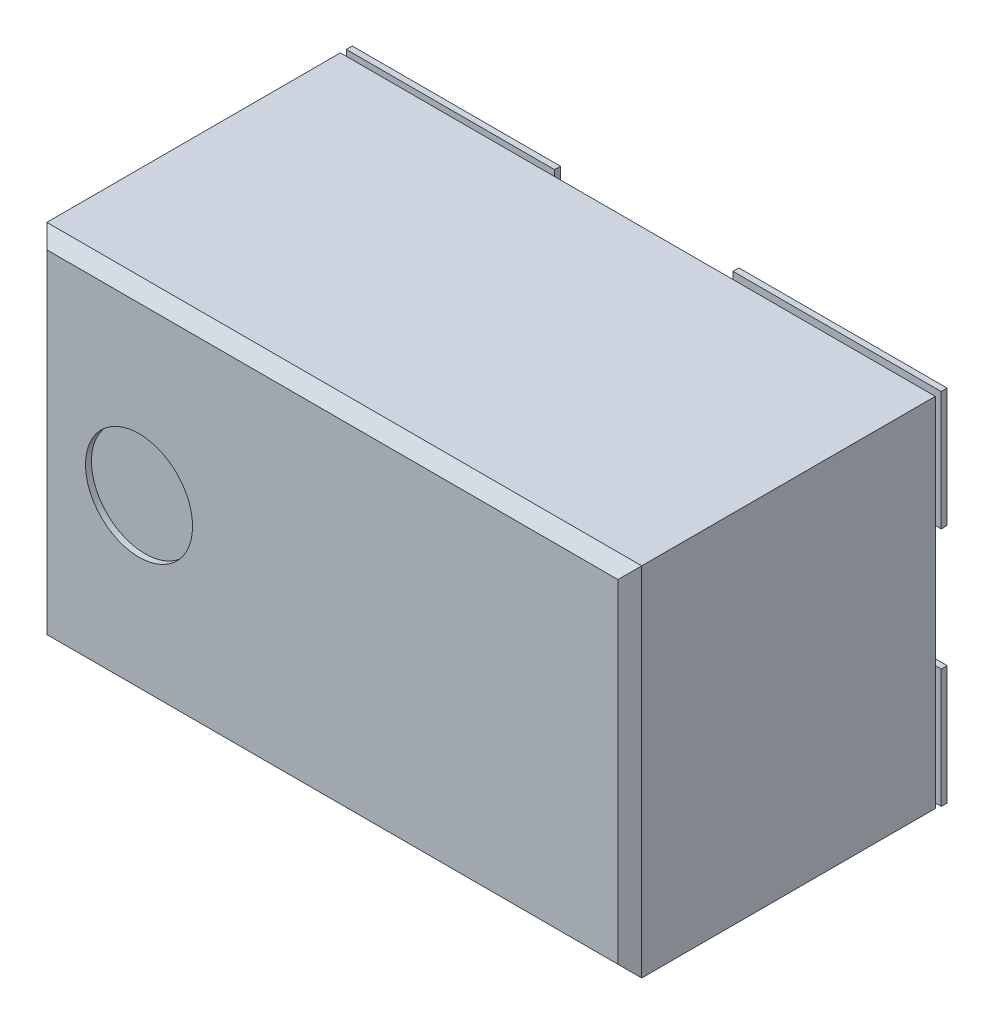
ISO-10303-21;
HEADER;
FILE_DESCRIPTION(('STEP AP214'),'2;1');
FILE_NAME('part.step','',(''),(''),'','','');
FILE_SCHEMA(('AUTOMOTIVE_DESIGN { 1 0 10303 214 1 1 1 1 }'));
ENDSEC;
DATA;
#1=APPLICATION_CONTEXT('core data for automotive mechanical design processes');
#2=APPLICATION_PROTOCOL_DEFINITION('international standard','automotive_design',2000,#1);
#3=PRODUCT_CONTEXT('',#1,'mechanical');
#4=PRODUCT('Part','Part','',(#3));
#5=PRODUCT_RELATED_PRODUCT_CATEGORY('part','',(#4));
#6=PRODUCT_DEFINITION_FORMATION('','',#4);
#7=PRODUCT_DEFINITION_CONTEXT('part definition',#1,'design');
#8=PRODUCT_DEFINITION('design','',#6,#7);
#9=PRODUCT_DEFINITION_SHAPE('','',#8);
#10=(LENGTH_UNIT() NAMED_UNIT(*) SI_UNIT(.MILLI.,.METRE.));
#11=(NAMED_UNIT(*) PLANE_ANGLE_UNIT() SI_UNIT($,.RADIAN.));
#12=(NAMED_UNIT(*) SI_UNIT($,.STERADIAN.) SOLID_ANGLE_UNIT());
#13=UNCERTAINTY_MEASURE_WITH_UNIT(LENGTH_MEASURE(1.E-05),#10,'distance_accuracy_value','');
#14=(GEOMETRIC_REPRESENTATION_CONTEXT(3) GLOBAL_UNCERTAINTY_ASSIGNED_CONTEXT((#13)) GLOBAL_UNIT_ASSIGNED_CONTEXT((#10,
#11,#12)) REPRESENTATION_CONTEXT('',''));
#15=CARTESIAN_POINT('',(0.,0.,0.));
#16=DIRECTION('',(0.,0.,1.));
#17=DIRECTION('',(1.,0.,0.));
#18=AXIS2_PLACEMENT_3D('',#15,#16,#17);
#19=CARTESIAN_POINT('',(0.,0.,0.0762));
#20=DIRECTION('',(0.,0.,1.));
#21=DIRECTION('',(1.,0.,0.));
#22=AXIS2_PLACEMENT_3D('',#19,#20,#21);
#23=PLANE('',#22);
#24=DIRECTION('',(1.,0.,0.));
#25=VECTOR('',#24,1.);
#26=CARTESIAN_POINT('',(-0.500000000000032,-0.30000000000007,0.0762));
#27=LINE('',#26,#25);
#28=CARTESIAN_POINT('',(-0.500000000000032,-0.30000000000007,0.0762));
#29=VERTEX_POINT('',#28);
#30=CARTESIAN_POINT('',(-0.15000000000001,-0.30000000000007,0.0762));
#31=VERTEX_POINT('',#30);
#32=EDGE_CURVE('E504',#29,#31,#27,.T.);
#33=ORIENTED_EDGE('',*,*,#32,.F.);
#34=DIRECTION('',(0.,1.,0.));
#35=VECTOR('',#34,1.);
#36=CARTESIAN_POINT('',(-0.500000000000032,0.30000000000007,0.0762));
#37=LINE('',#36,#35);
#38=CARTESIAN_POINT('',(-0.500000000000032,0.30000000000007,0.0762));
#39=VERTEX_POINT('',#38);
#40=EDGE_CURVE('E509',#39,#29,#37,.F.);
#41=ORIENTED_EDGE('',*,*,#40,.F.);
#42=DIRECTION('',(1.,0.,0.));
#43=VECTOR('',#42,1.);
#44=CARTESIAN_POINT('',(-0.15000000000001,0.30000000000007,0.0762));
#45=LINE('',#44,#43);
#46=CARTESIAN_POINT('',(-0.15000000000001,0.30000000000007,0.0762));
#47=VERTEX_POINT('',#46);
#48=EDGE_CURVE('E471',#47,#39,#45,.F.);
#49=ORIENTED_EDGE('',*,*,#48,.F.);
#50=DIRECTION('',(0.,1.,0.));
#51=VECTOR('',#50,1.);
#52=CARTESIAN_POINT('',(-0.15000000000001,-0.30000000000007,0.0762));
#53=LINE('',#52,#51);
#54=EDGE_CURVE('E499',#31,#47,#53,.T.);
#55=ORIENTED_EDGE('',*,*,#54,.F.);
#56=EDGE_LOOP('',(#33,#41,#49,#55));
#57=FACE_BOUND('',#56,.T.);
#58=ADVANCED_FACE('F16',(#57),#23,.F.);
#59=CARTESIAN_POINT('',(-0.500000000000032,0.30000000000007,0.0762));
#60=DIRECTION('',(-1.,0.,0.));
#61=DIRECTION('',(0.,0.,1.));
#62=AXIS2_PLACEMENT_3D('',#59,#60,#61);
#63=PLANE('',#62);
#64=DIRECTION('',(0.,0.,1.));
#65=VECTOR('',#64,1.);
#66=CARTESIAN_POINT('',(-0.500000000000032,0.30000000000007,0.0762));
#67=LINE('',#66,#65);
#68=CARTESIAN_POINT('',(-0.500000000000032,0.30000000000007,0.0862000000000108));
#69=VERTEX_POINT('',#68);
#70=EDGE_CURVE('E496',#39,#69,#67,.T.);
#71=ORIENTED_EDGE('',*,*,#70,.F.);
#72=ORIENTED_EDGE('',*,*,#40,.T.);
#73=DIRECTION('',(0.,0.,-1.));
#74=VECTOR('',#73,1.);
#75=CARTESIAN_POINT('',(-0.500000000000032,-0.30000000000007,0.0762));
#76=LINE('',#75,#74);
#77=CARTESIAN_POINT('',(-0.500000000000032,-0.30000000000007,0.0862000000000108));
#78=VERTEX_POINT('',#77);
#79=EDGE_CURVE('E506',#78,#29,#76,.T.);
#80=ORIENTED_EDGE('',*,*,#79,.F.);
#81=DIRECTION('',(0.,1.,0.));
#82=VECTOR('',#81,1.);
#83=CARTESIAN_POINT('',(-0.500000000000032,0.,0.0862000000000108));
#84=LINE('',#83,#82);
#85=EDGE_CURVE('E406',#69,#78,#84,.F.);
#86=ORIENTED_EDGE('',*,*,#85,.F.);
#87=EDGE_LOOP('',(#71,#72,#80,#86));
#88=FACE_BOUND('',#87,.T.);
#89=ADVANCED_FACE('F809',(#88),#63,.T.);
#90=CARTESIAN_POINT('',(-0.500000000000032,-0.30000000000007,0.0762));
#91=DIRECTION('',(0.,-1.,0.));
#92=DIRECTION('',(0.,0.,-1.));
#93=AXIS2_PLACEMENT_3D('',#90,#91,#92);
#94=PLANE('',#93);
#95=ORIENTED_EDGE('',*,*,#79,.T.);
#96=ORIENTED_EDGE('',*,*,#32,.T.);
#97=DIRECTION('',(0.,0.,-1.));
#98=VECTOR('',#97,1.);
#99=CARTESIAN_POINT('',(-0.15000000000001,-0.30000000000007,0.0762));
#100=LINE('',#99,#98);
#101=CARTESIAN_POINT('',(-0.15000000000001,-0.30000000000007,0.0862000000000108));
#102=VERTEX_POINT('',#101);
#103=EDGE_CURVE('E501',#102,#31,#100,.T.);
#104=ORIENTED_EDGE('',*,*,#103,.F.);
#105=DIRECTION('',(1.,0.,0.));
#106=VECTOR('',#105,1.);
#107=CARTESIAN_POINT('',(0.,-0.30000000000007,0.0862000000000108));
#108=LINE('',#107,#106);
#109=EDGE_CURVE('E403',#78,#102,#108,.T.);
#110=ORIENTED_EDGE('',*,*,#109,.F.);
#111=EDGE_LOOP('',(#95,#96,#104,#110));
#112=FACE_BOUND('',#111,.T.);
#113=ADVANCED_FACE('F806',(#112),#94,.T.);
#114=CARTESIAN_POINT('',(-0.15000000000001,-0.30000000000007,0.0762));
#115=DIRECTION('',(1.,0.,0.));
#116=DIRECTION('',(0.,0.,-1.));
#117=AXIS2_PLACEMENT_3D('',#114,#115,#116);
#118=PLANE('',#117);
#119=ORIENTED_EDGE('',*,*,#103,.T.);
#120=ORIENTED_EDGE('',*,*,#54,.T.);
#121=DIRECTION('',(0.,0.,1.));
#122=VECTOR('',#121,1.);
#123=CARTESIAN_POINT('',(-0.15000000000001,0.30000000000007,0.0762));
#124=LINE('',#123,#122);
#125=CARTESIAN_POINT('',(-0.15000000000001,0.30000000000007,0.0862000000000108));
#126=VERTEX_POINT('',#125);
#127=EDGE_CURVE('E493',#126,#47,#124,.F.);
#128=ORIENTED_EDGE('',*,*,#127,.F.);
#129=DIRECTION('',(0.,1.,0.));
#130=VECTOR('',#129,1.);
#131=CARTESIAN_POINT('',(-0.15000000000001,0.,0.0862000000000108));
#132=LINE('',#131,#130);
#133=EDGE_CURVE('E400',#102,#126,#132,.T.);
#134=ORIENTED_EDGE('',*,*,#133,.F.);
#135=EDGE_LOOP('',(#119,#120,#128,#134));
#136=FACE_BOUND('',#135,.T.);
#137=ADVANCED_FACE('F802',(#136),#118,.T.);
#138=CARTESIAN_POINT('',(-0.15000000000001,0.30000000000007,0.0762));
#139=DIRECTION('',(0.,1.,0.));
#140=DIRECTION('',(0.,0.,1.));
#141=AXIS2_PLACEMENT_3D('',#138,#139,#140);
#142=PLANE('',#141);
#143=ORIENTED_EDGE('',*,*,#127,.T.);
#144=ORIENTED_EDGE('',*,*,#48,.T.);
#145=ORIENTED_EDGE('',*,*,#70,.T.);
#146=DIRECTION('',(1.,0.,0.));
#147=VECTOR('',#146,1.);
#148=CARTESIAN_POINT('',(0.,0.30000000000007,0.0862000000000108));
#149=LINE('',#148,#147);
#150=EDGE_CURVE('E396',#126,#69,#149,.F.);
#151=ORIENTED_EDGE('',*,*,#150,.F.);
#152=EDGE_LOOP('',(#143,#144,#145,#151));
#153=FACE_BOUND('',#152,.T.);
#154=ADVANCED_FACE('F798',(#153),#142,.T.);
#155=CARTESIAN_POINT('',(0.500000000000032,0.101999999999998,0.0762));
#156=DIRECTION('',(1.,0.,0.));
#157=DIRECTION('',(0.,0.,-1.));
#158=AXIS2_PLACEMENT_3D('',#155,#156,#157);
#159=PLANE('',#158);
#160=DIRECTION('',(0.,0.,-1.));
#161=VECTOR('',#160,1.);
#162=CARTESIAN_POINT('',(0.500000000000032,0.101999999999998,0.0762));
#163=LINE('',#162,#161);
#164=CARTESIAN_POINT('',(0.500000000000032,0.101999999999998,0.0762));
#165=VERTEX_POINT('',#164);
#166=CARTESIAN_POINT('',(0.500000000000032,0.101999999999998,0.0862000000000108));
#167=VERTEX_POINT('',#166);
#168=EDGE_CURVE('E399',#165,#167,#163,.F.);
#169=ORIENTED_EDGE('',*,*,#168,.F.);
#170=DIRECTION('',(0.,1.,0.));
#171=VECTOR('',#170,1.);
#172=CARTESIAN_POINT('',(0.500000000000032,0.,0.0762));
#173=LINE('',#172,#171);
#174=CARTESIAN_POINT('',(0.500000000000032,0.302000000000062,0.0762));
#175=VERTEX_POINT('',#174);
#176=EDGE_CURVE('E247',#165,#175,#173,.T.);
#177=ORIENTED_EDGE('',*,*,#176,.T.);
#178=DIRECTION('',(0.,0.,1.));
#179=VECTOR('',#178,1.);
#180=CARTESIAN_POINT('',(0.500000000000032,0.302000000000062,0.0762));
#181=LINE('',#180,#179);
#182=CARTESIAN_POINT('',(0.500000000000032,0.302000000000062,0.0862000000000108));
#183=VERTEX_POINT('',#182);
#184=EDGE_CURVE('E462',#183,#175,#181,.F.);
#185=ORIENTED_EDGE('',*,*,#184,.F.);
#186=DIRECTION('',(0.,1.,0.));
#187=VECTOR('',#186,1.);
#188=CARTESIAN_POINT('',(0.500000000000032,0.,0.0862000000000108));
#189=LINE('',#188,#187);
#190=EDGE_CURVE('E389',#167,#183,#189,.T.);
#191=ORIENTED_EDGE('',*,*,#190,.F.);
#192=EDGE_LOOP('',(#169,#177,#185,#191));
#193=FACE_BOUND('',#192,.T.);
#194=ADVANCED_FACE('F794',(#193),#159,.T.);
#195=CARTESIAN_POINT('',(0.500000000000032,0.302000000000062,0.0762));
#196=DIRECTION('',(0.,1.,0.));
#197=DIRECTION('',(0.,0.,1.));
#198=AXIS2_PLACEMENT_3D('',#195,#196,#197);
#199=PLANE('',#198);
#200=ORIENTED_EDGE('',*,*,#184,.T.);
#201=DIRECTION('',(1.,0.,0.));
#202=VECTOR('',#201,1.);
#203=CARTESIAN_POINT('',(0.,0.302000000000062,0.0762));
#204=LINE('',#203,#202);
#205=CARTESIAN_POINT('',(0.15000000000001,0.302000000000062,0.0762));
#206=VERTEX_POINT('',#205);
#207=EDGE_CURVE('E482',#175,#206,#204,.F.);
#208=ORIENTED_EDGE('',*,*,#207,.T.);
#209=DIRECTION('',(0.,0.,1.));
#210=VECTOR('',#209,1.);
#211=CARTESIAN_POINT('',(0.15000000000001,0.302000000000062,0.0762));
#212=LINE('',#211,#210);
#213=CARTESIAN_POINT('',(0.15000000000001,0.302000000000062,0.0862000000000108));
#214=VERTEX_POINT('',#213);
#215=EDGE_CURVE('E431',#214,#206,#212,.F.);
#216=ORIENTED_EDGE('',*,*,#215,.F.);
#217=DIRECTION('',(1.,0.,0.));
#218=VECTOR('',#217,1.);
#219=CARTESIAN_POINT('',(0.,0.302000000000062,0.0862000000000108));
#220=LINE('',#219,#218);
#221=EDGE_CURVE('E457',#183,#214,#220,.F.);
#222=ORIENTED_EDGE('',*,*,#221,.F.);
#223=EDGE_LOOP('',(#200,#208,#216,#222));
#224=FACE_BOUND('',#223,.T.);
#225=ADVANCED_FACE('F790',(#224),#199,.T.);
#226=CARTESIAN_POINT('',(0.15000000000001,0.302000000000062,0.0762));
#227=DIRECTION('',(-1.,0.,0.));
#228=DIRECTION('',(0.,0.,1.));
#229=AXIS2_PLACEMENT_3D('',#226,#227,#228);
#230=PLANE('',#229);
#231=ORIENTED_EDGE('',*,*,#215,.T.);
#232=DIRECTION('',(0.,1.,0.));
#233=VECTOR('',#232,1.);
#234=CARTESIAN_POINT('',(0.15000000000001,0.,0.0762));
#235=LINE('',#234,#233);
#236=CARTESIAN_POINT('',(0.15000000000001,0.101999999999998,0.0762));
#237=VERTEX_POINT('',#236);
#238=EDGE_CURVE('E365',#206,#237,#235,.F.);
#239=ORIENTED_EDGE('',*,*,#238,.T.);
#240=DIRECTION('',(0.,0.,-1.));
#241=VECTOR('',#240,1.);
#242=CARTESIAN_POINT('',(0.15000000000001,0.101999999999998,0.0762));
#243=LINE('',#242,#241);
#244=CARTESIAN_POINT('',(0.15000000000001,0.101999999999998,0.0862000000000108));
#245=VERTEX_POINT('',#244);
#246=EDGE_CURVE('E249',#245,#237,#243,.T.);
#247=ORIENTED_EDGE('',*,*,#246,.F.);
#248=DIRECTION('',(0.,1.,0.));
#249=VECTOR('',#248,1.);
#250=CARTESIAN_POINT('',(0.15000000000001,0.,0.0862000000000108));
#251=LINE('',#250,#249);
#252=EDGE_CURVE('E374',#214,#245,#251,.F.);
#253=ORIENTED_EDGE('',*,*,#252,.F.);
#254=EDGE_LOOP('',(#231,#239,#247,#253));
#255=FACE_BOUND('',#254,.T.);
#256=ADVANCED_FACE('F786',(#255),#230,.T.);
#257=CARTESIAN_POINT('',(0.15000000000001,-0.101999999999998,0.0762));
#258=DIRECTION('',(-1.,0.,0.));
#259=DIRECTION('',(0.,0.,1.));
#260=AXIS2_PLACEMENT_3D('',#257,#258,#259);
#261=PLANE('',#260);
#262=DIRECTION('',(0.,0.,1.));
#263=VECTOR('',#262,1.);
#264=CARTESIAN_POINT('',(0.15000000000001,-0.101999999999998,0.0762));
#265=LINE('',#264,#263);
#266=CARTESIAN_POINT('',(0.15000000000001,-0.101999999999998,0.0762));
#267=VERTEX_POINT('',#266);
#268=CARTESIAN_POINT('',(0.15000000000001,-0.101999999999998,0.0862000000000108));
#269=VERTEX_POINT('',#268);
#270=EDGE_CURVE('E295',#267,#269,#265,.T.);
#271=ORIENTED_EDGE('',*,*,#270,.F.);
#272=DIRECTION('',(0.,1.,0.));
#273=VECTOR('',#272,1.);
#274=CARTESIAN_POINT('',(0.15000000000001,0.,0.0762));
#275=LINE('',#274,#273);
#276=CARTESIAN_POINT('',(0.15000000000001,-0.302000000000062,0.0762));
#277=VERTEX_POINT('',#276);
#278=EDGE_CURVE('E412',#267,#277,#275,.F.);
#279=ORIENTED_EDGE('',*,*,#278,.T.);
#280=DIRECTION('',(0.,0.,-1.));
#281=VECTOR('',#280,1.);
#282=CARTESIAN_POINT('',(0.15000000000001,-0.302000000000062,0.0762));
#283=LINE('',#282,#281);
#284=CARTESIAN_POINT('',(0.15000000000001,-0.302000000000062,0.0862000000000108));
#285=VERTEX_POINT('',#284);
#286=EDGE_CURVE('E422',#285,#277,#283,.T.);
#287=ORIENTED_EDGE('',*,*,#286,.F.);
#288=DIRECTION('',(0.,1.,0.));
#289=VECTOR('',#288,1.);
#290=CARTESIAN_POINT('',(0.15000000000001,0.,0.0862000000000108));
#291=LINE('',#290,#289);
#292=EDGE_CURVE('E308',#269,#285,#291,.F.);
#293=ORIENTED_EDGE('',*,*,#292,.F.);
#294=EDGE_LOOP('',(#271,#279,#287,#293));
#295=FACE_BOUND('',#294,.T.);
#296=ADVANCED_FACE('F782',(#295),#261,.T.);
#297=CARTESIAN_POINT('',(0.15000000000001,-0.302000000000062,0.0762));
#298=DIRECTION('',(0.,-1.,0.));
#299=DIRECTION('',(0.,0.,-1.));
#300=AXIS2_PLACEMENT_3D('',#297,#298,#299);
#301=PLANE('',#300);
#302=ORIENTED_EDGE('',*,*,#286,.T.);
#303=DIRECTION('',(1.,0.,0.));
#304=VECTOR('',#303,1.);
#305=CARTESIAN_POINT('',(0.,-0.302000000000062,0.0762));
#306=LINE('',#305,#304);
#307=CARTESIAN_POINT('',(0.500000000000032,-0.302000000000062,0.0762));
#308=VERTEX_POINT('',#307);
#309=EDGE_CURVE('E442',#277,#308,#306,.T.);
#310=ORIENTED_EDGE('',*,*,#309,.T.);
#311=DIRECTION('',(0.,0.,-1.));
#312=VECTOR('',#311,1.);
#313=CARTESIAN_POINT('',(0.500000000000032,-0.302000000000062,0.0762));
#314=LINE('',#313,#312);
#315=CARTESIAN_POINT('',(0.500000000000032,-0.302000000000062,0.0862000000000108));
#316=VERTEX_POINT('',#315);
#317=EDGE_CURVE('E409',#316,#308,#314,.T.);
#318=ORIENTED_EDGE('',*,*,#317,.F.);
#319=DIRECTION('',(1.,0.,0.));
#320=VECTOR('',#319,1.);
#321=CARTESIAN_POINT('',(0.,-0.302000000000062,0.0862000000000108));
#322=LINE('',#321,#320);
#323=EDGE_CURVE('E417',#285,#316,#322,.T.);
#324=ORIENTED_EDGE('',*,*,#323,.F.);
#325=EDGE_LOOP('',(#302,#310,#318,#324));
#326=FACE_BOUND('',#325,.T.);
#327=ADVANCED_FACE('F778',(#326),#301,.T.);
#328=CARTESIAN_POINT('',(0.500000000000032,-0.302000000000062,0.0762));
#329=DIRECTION('',(1.,0.,0.));
#330=DIRECTION('',(0.,0.,-1.));
#331=AXIS2_PLACEMENT_3D('',#328,#329,#330);
#332=PLANE('',#331);
#333=ORIENTED_EDGE('',*,*,#317,.T.);
#334=DIRECTION('',(0.,1.,0.));
#335=VECTOR('',#334,1.);
#336=CARTESIAN_POINT('',(0.500000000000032,0.,0.0762));
#337=LINE('',#336,#335);
#338=CARTESIAN_POINT('',(0.500000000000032,-0.101999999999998,0.0762));
#339=VERTEX_POINT('',#338);
#340=EDGE_CURVE('E312',#308,#339,#337,.T.);
#341=ORIENTED_EDGE('',*,*,#340,.T.);
#342=DIRECTION('',(0.,0.,1.));
#343=VECTOR('',#342,1.);
#344=CARTESIAN_POINT('',(0.500000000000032,-0.101999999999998,0.0762));
#345=LINE('',#344,#343);
#346=CARTESIAN_POINT('',(0.500000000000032,-0.101999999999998,0.0862000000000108));
#347=VERTEX_POINT('',#346);
#348=EDGE_CURVE('E373',#347,#339,#345,.F.);
#349=ORIENTED_EDGE('',*,*,#348,.F.);
#350=DIRECTION('',(0.,1.,0.));
#351=VECTOR('',#350,1.);
#352=CARTESIAN_POINT('',(0.500000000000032,0.,0.0862000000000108));
#353=LINE('',#352,#351);
#354=EDGE_CURVE('E343',#316,#347,#353,.T.);
#355=ORIENTED_EDGE('',*,*,#354,.F.);
#356=EDGE_LOOP('',(#333,#341,#349,#355));
#357=FACE_BOUND('',#356,.T.);
#358=ADVANCED_FACE('F774',(#357),#332,.T.);
#359=CARTESIAN_POINT('',(0.,0.,0.0862000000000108));
#360=DIRECTION('',(0.,0.,1.));
#361=DIRECTION('',(1.,0.,0.));
#362=AXIS2_PLACEMENT_3D('',#359,#360,#361);
#363=PLANE('',#362);
#364=DIRECTION('',(1.,0.,0.));
#365=VECTOR('',#364,1.);
#366=CARTESIAN_POINT('',(-0.449999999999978,-0.249999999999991,0.0862000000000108));
#367=LINE('',#366,#365);
#368=CARTESIAN_POINT('',(-0.449999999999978,-0.249999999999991,0.0862000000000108));
#369=VERTEX_POINT('',#368);
#370=CARTESIAN_POINT('',(-0.199999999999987,-0.249999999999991,0.0862000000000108));
#371=VERTEX_POINT('',#370);
#372=EDGE_CURVE('E289',#369,#371,#367,.T.);
#373=ORIENTED_EDGE('',*,*,#372,.F.);
#374=DIRECTION('',(0.,1.,0.));
#375=VECTOR('',#374,1.);
#376=CARTESIAN_POINT('',(-0.449999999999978,0.249999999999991,0.0862000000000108));
#377=LINE('',#376,#375);
#378=CARTESIAN_POINT('',(-0.449999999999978,0.249999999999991,0.0862000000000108));
#379=VERTEX_POINT('',#378);
#380=EDGE_CURVE('E264',#379,#369,#377,.F.);
#381=ORIENTED_EDGE('',*,*,#380,.F.);
#382=DIRECTION('',(1.,0.,0.));
#383=VECTOR('',#382,1.);
#384=CARTESIAN_POINT('',(-0.199999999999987,0.249999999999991,0.0862000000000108));
#385=LINE('',#384,#383);
#386=CARTESIAN_POINT('',(-0.199999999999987,0.249999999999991,0.0862000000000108));
#387=VERTEX_POINT('',#386);
#388=EDGE_CURVE('E279',#387,#379,#385,.F.);
#389=ORIENTED_EDGE('',*,*,#388,.F.);
#390=DIRECTION('',(0.,1.,0.));
#391=VECTOR('',#390,1.);
#392=CARTESIAN_POINT('',(-0.199999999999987,-0.249999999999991,0.0862000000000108));
#393=LINE('',#392,#391);
#394=EDGE_CURVE('E284',#371,#387,#393,.T.);
#395=ORIENTED_EDGE('',*,*,#394,.F.);
#396=EDGE_LOOP('',(#373,#381,#389,#395));
#397=FACE_BOUND('',#396,.T.);
#398=ORIENTED_EDGE('',*,*,#133,.T.);
#399=ORIENTED_EDGE('',*,*,#150,.T.);
#400=ORIENTED_EDGE('',*,*,#85,.T.);
#401=ORIENTED_EDGE('',*,*,#109,.T.);
#402=EDGE_LOOP('',(#398,#399,#400,#401));
#403=FACE_BOUND('',#402,.T.);
#404=ADVANCED_FACE('F771',(#397,#403),#363,.T.);
#405=CARTESIAN_POINT('',(0.15000000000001,0.101999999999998,0.0762));
#406=DIRECTION('',(0.,-1.,0.));
#407=DIRECTION('',(0.,0.,-1.));
#408=AXIS2_PLACEMENT_3D('',#405,#406,#407);
#409=PLANE('',#408);
#410=DIRECTION('',(1.,0.,0.));
#411=VECTOR('',#410,1.);
#412=CARTESIAN_POINT('',(0.,0.101999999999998,0.0862000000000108));
#413=LINE('',#412,#411);
#414=CARTESIAN_POINT('',(0.449999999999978,0.101999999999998,0.0862000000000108));
#415=VERTEX_POINT('',#414);
#416=EDGE_CURVE('E255',#415,#167,#413,.T.);
#417=ORIENTED_EDGE('',*,*,#416,.F.);
#418=DIRECTION('',(0.,0.,-1.));
#419=VECTOR('',#418,1.);
#420=CARTESIAN_POINT('',(0.449999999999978,0.101999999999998,0.0762));
#421=LINE('',#420,#419);
#422=CARTESIAN_POINT('',(0.449999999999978,0.101999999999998,0.0762));
#423=VERTEX_POINT('',#422);
#424=EDGE_CURVE('E252',#423,#415,#421,.F.);
#425=ORIENTED_EDGE('',*,*,#424,.F.);
#426=DIRECTION('',(1.,0.,0.));
#427=VECTOR('',#426,1.);
#428=CARTESIAN_POINT('',(0.,0.101999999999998,0.0762));
#429=LINE('',#428,#427);
#430=EDGE_CURVE('E240',#423,#165,#429,.T.);
#431=ORIENTED_EDGE('',*,*,#430,.T.);
#432=ORIENTED_EDGE('',*,*,#168,.T.);
#433=EDGE_LOOP('',(#417,#425,#431,#432));
#434=FACE_BOUND('',#433,.T.);
#435=ADVANCED_FACE('F253',(#434),#409,.T.);
#436=CARTESIAN_POINT('',(0.15000000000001,0.101999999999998,0.0762));
#437=DIRECTION('',(0.,-1.,0.));
#438=DIRECTION('',(0.,0.,-1.));
#439=AXIS2_PLACEMENT_3D('',#436,#437,#438);
#440=PLANE('',#439);
#441=DIRECTION('',(1.,0.,0.));
#442=VECTOR('',#441,1.);
#443=CARTESIAN_POINT('',(0.,0.101999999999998,0.0762));
#444=LINE('',#443,#442);
#445=CARTESIAN_POINT('',(0.199999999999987,0.101999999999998,0.0762));
#446=VERTEX_POINT('',#445);
#447=EDGE_CURVE('E363',#237,#446,#444,.T.);
#448=ORIENTED_EDGE('',*,*,#447,.T.);
#449=DIRECTION('',(0.,0.,1.));
#450=VECTOR('',#449,1.);
#451=CARTESIAN_POINT('',(0.199999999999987,0.101999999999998,0.0762));
#452=LINE('',#451,#450);
#453=CARTESIAN_POINT('',(0.199999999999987,0.101999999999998,0.0862000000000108));
#454=VERTEX_POINT('',#453);
#455=EDGE_CURVE('E522',#454,#446,#452,.F.);
#456=ORIENTED_EDGE('',*,*,#455,.F.);
#457=DIRECTION('',(1.,0.,0.));
#458=VECTOR('',#457,1.);
#459=CARTESIAN_POINT('',(0.,0.101999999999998,0.0862000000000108));
#460=LINE('',#459,#458);
#461=EDGE_CURVE('E370',#245,#454,#460,.T.);
#462=ORIENTED_EDGE('',*,*,#461,.F.);
#463=ORIENTED_EDGE('',*,*,#246,.T.);
#464=EDGE_LOOP('',(#448,#456,#462,#463));
#465=FACE_BOUND('',#464,.T.);
#466=ADVANCED_FACE('F765',(#465),#440,.T.);
#467=CARTESIAN_POINT('',(0.,0.,0.0762));
#468=DIRECTION('',(0.,0.,1.));
#469=DIRECTION('',(1.,0.,0.));
#470=AXIS2_PLACEMENT_3D('',#467,#468,#469);
#471=PLANE('',#470);
#472=DIRECTION('',(0.,1.,0.));
#473=VECTOR('',#472,1.);
#474=CARTESIAN_POINT('',(0.199999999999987,0.249999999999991,0.0762));
#475=LINE('',#474,#473);
#476=CARTESIAN_POINT('',(0.199999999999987,0.100000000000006,0.0762));
#477=VERTEX_POINT('',#476);
#478=EDGE_CURVE('E519',#446,#477,#475,.F.);
#479=ORIENTED_EDGE('',*,*,#478,.F.);
#480=ORIENTED_EDGE('',*,*,#447,.F.);
#481=ORIENTED_EDGE('',*,*,#238,.F.);
#482=ORIENTED_EDGE('',*,*,#207,.F.);
#483=ORIENTED_EDGE('',*,*,#176,.F.);
#484=ORIENTED_EDGE('',*,*,#430,.F.);
#485=DIRECTION('',(0.,1.,0.));
#486=VECTOR('',#485,1.);
#487=CARTESIAN_POINT('',(0.449999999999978,0.100000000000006,0.0762));
#488=LINE('',#487,#486);
#489=CARTESIAN_POINT('',(0.449999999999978,0.100000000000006,0.0762));
#490=VERTEX_POINT('',#489);
#491=EDGE_CURVE('E19',#490,#423,#488,.T.);
#492=ORIENTED_EDGE('',*,*,#491,.F.);
#493=DIRECTION('',(1.,0.,0.));
#494=VECTOR('',#493,1.);
#495=CARTESIAN_POINT('',(0.199999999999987,0.100000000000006,0.0762));
#496=LINE('',#495,#494);
#497=EDGE_CURVE('E234',#477,#490,#496,.T.);
#498=ORIENTED_EDGE('',*,*,#497,.F.);
#499=EDGE_LOOP('',(#479,#480,#481,#482,#483,#484,#492,#498));
#500=FACE_BOUND('',#499,.T.);
#501=ADVANCED_FACE('F243',(#500),#471,.F.);
#502=CARTESIAN_POINT('',(0.,0.,0.0862000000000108));
#503=DIRECTION('',(0.,0.,1.));
#504=DIRECTION('',(1.,0.,0.));
#505=AXIS2_PLACEMENT_3D('',#502,#503,#504);
#506=PLANE('',#505);
#507=ORIENTED_EDGE('',*,*,#461,.T.);
#508=DIRECTION('',(0.,1.,0.));
#509=VECTOR('',#508,1.);
#510=CARTESIAN_POINT('',(0.199999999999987,0.249999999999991,0.0862000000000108));
#511=LINE('',#510,#509);
#512=CARTESIAN_POINT('',(0.199999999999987,0.249999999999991,0.0862000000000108));
#513=VERTEX_POINT('',#512);
#514=EDGE_CURVE('E377',#513,#454,#511,.F.);
#515=ORIENTED_EDGE('',*,*,#514,.F.);
#516=DIRECTION('',(1.,0.,0.));
#517=VECTOR('',#516,1.);
#518=CARTESIAN_POINT('',(0.449999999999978,0.249999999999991,0.0862000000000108));
#519=LINE('',#518,#517);
#520=CARTESIAN_POINT('',(0.449999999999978,0.249999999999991,0.0862000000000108));
#521=VERTEX_POINT('',#520);
#522=EDGE_CURVE('E527',#521,#513,#519,.F.);
#523=ORIENTED_EDGE('',*,*,#522,.F.);
#524=DIRECTION('',(0.,1.,0.));
#525=VECTOR('',#524,1.);
#526=CARTESIAN_POINT('',(0.449999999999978,0.100000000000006,0.0862000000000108));
#527=LINE('',#526,#525);
#528=EDGE_CURVE('E258',#415,#521,#527,.T.);
#529=ORIENTED_EDGE('',*,*,#528,.F.);
#530=ORIENTED_EDGE('',*,*,#416,.T.);
#531=ORIENTED_EDGE('',*,*,#190,.T.);
#532=ORIENTED_EDGE('',*,*,#221,.T.);
#533=ORIENTED_EDGE('',*,*,#252,.T.);
#534=EDGE_LOOP('',(#507,#515,#523,#529,#530,#531,#532,#533));
#535=FACE_BOUND('',#534,.T.);
#536=ADVANCED_FACE('F543',(#535),#506,.T.);
#537=CARTESIAN_POINT('',(0.500000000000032,-0.101999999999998,0.0762));
#538=DIRECTION('',(0.,1.,0.));
#539=DIRECTION('',(0.,0.,1.));
#540=AXIS2_PLACEMENT_3D('',#537,#538,#539);
#541=PLANE('',#540);
#542=DIRECTION('',(1.,0.,0.));
#543=VECTOR('',#542,1.);
#544=CARTESIAN_POINT('',(0.,-0.101999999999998,0.0762));
#545=LINE('',#544,#543);
#546=CARTESIAN_POINT('',(0.449999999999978,-0.101999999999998,0.0762));
#547=VERTEX_POINT('',#546);
#548=EDGE_CURVE('E296',#339,#547,#545,.F.);
#549=ORIENTED_EDGE('',*,*,#548,.T.);
#550=DIRECTION('',(0.,0.,-1.));
#551=VECTOR('',#550,1.);
#552=CARTESIAN_POINT('',(0.449999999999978,-0.101999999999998,0.0762));
#553=LINE('',#552,#551);
#554=CARTESIAN_POINT('',(0.449999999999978,-0.101999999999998,0.0862000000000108));
#555=VERTEX_POINT('',#554);
#556=EDGE_CURVE('E380',#555,#547,#553,.T.);
#557=ORIENTED_EDGE('',*,*,#556,.F.);
#558=DIRECTION('',(1.,0.,0.));
#559=VECTOR('',#558,1.);
#560=CARTESIAN_POINT('',(0.,-0.101999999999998,0.0862000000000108));
#561=LINE('',#560,#559);
#562=EDGE_CURVE('E291',#347,#555,#561,.F.);
#563=ORIENTED_EDGE('',*,*,#562,.F.);
#564=ORIENTED_EDGE('',*,*,#348,.T.);
#565=EDGE_LOOP('',(#549,#557,#563,#564));
#566=FACE_BOUND('',#565,.T.);
#567=ADVANCED_FACE('F756',(#566),#541,.T.);
#568=CARTESIAN_POINT('',(0.,0.,0.0762));
#569=DIRECTION('',(0.,0.,1.));
#570=DIRECTION('',(1.,0.,0.));
#571=AXIS2_PLACEMENT_3D('',#568,#569,#570);
#572=PLANE('',#571);
#573=DIRECTION('',(0.,1.,0.));
#574=VECTOR('',#573,1.);
#575=CARTESIAN_POINT('',(0.449999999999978,-0.249999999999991,0.0762));
#576=LINE('',#575,#574);
#577=CARTESIAN_POINT('',(0.449999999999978,-0.100000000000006,0.0762));
#578=VERTEX_POINT('',#577);
#579=EDGE_CURVE('E348',#547,#578,#576,.T.);
#580=ORIENTED_EDGE('',*,*,#579,.F.);
#581=ORIENTED_EDGE('',*,*,#548,.F.);
#582=ORIENTED_EDGE('',*,*,#340,.F.);
#583=ORIENTED_EDGE('',*,*,#309,.F.);
#584=ORIENTED_EDGE('',*,*,#278,.F.);
#585=DIRECTION('',(1.,0.,0.));
#586=VECTOR('',#585,1.);
#587=CARTESIAN_POINT('',(0.500000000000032,-0.101999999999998,0.0762));
#588=LINE('',#587,#586);
#589=CARTESIAN_POINT('',(0.199999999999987,-0.101999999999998,0.0762));
#590=VERTEX_POINT('',#589);
#591=EDGE_CURVE('E292',#590,#267,#588,.F.);
#592=ORIENTED_EDGE('',*,*,#591,.F.);
#593=DIRECTION('',(0.,1.,0.));
#594=VECTOR('',#593,1.);
#595=CARTESIAN_POINT('',(0.199999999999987,-0.100000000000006,0.0762));
#596=LINE('',#595,#594);
#597=CARTESIAN_POINT('',(0.199999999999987,-0.100000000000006,0.0762));
#598=VERTEX_POINT('',#597);
#599=EDGE_CURVE('E516',#598,#590,#596,.F.);
#600=ORIENTED_EDGE('',*,*,#599,.F.);
#601=DIRECTION('',(1.,0.,0.));
#602=VECTOR('',#601,1.);
#603=CARTESIAN_POINT('',(0.449999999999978,-0.100000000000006,0.0762));
#604=LINE('',#603,#602);
#605=EDGE_CURVE('E315',#578,#598,#604,.F.);
#606=ORIENTED_EDGE('',*,*,#605,.F.);
#607=EDGE_LOOP('',(#580,#581,#582,#583,#584,#592,#600,#606));
#608=FACE_BOUND('',#607,.T.);
#609=ADVANCED_FACE('F752',(#608),#572,.F.);
#610=CARTESIAN_POINT('',(0.500000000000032,-0.101999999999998,0.0762));
#611=DIRECTION('',(0.,1.,0.));
#612=DIRECTION('',(0.,0.,1.));
#613=AXIS2_PLACEMENT_3D('',#610,#611,#612);
#614=PLANE('',#613);
#615=DIRECTION('',(1.,0.,0.));
#616=VECTOR('',#615,1.);
#617=CARTESIAN_POINT('',(0.,-0.101999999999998,0.0862000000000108));
#618=LINE('',#617,#616);
#619=CARTESIAN_POINT('',(0.199999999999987,-0.101999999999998,0.0862000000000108));
#620=VERTEX_POINT('',#619);
#621=EDGE_CURVE('E305',#620,#269,#618,.F.);
#622=ORIENTED_EDGE('',*,*,#621,.F.);
#623=DIRECTION('',(0.,0.,1.));
#624=VECTOR('',#623,1.);
#625=CARTESIAN_POINT('',(0.199999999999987,-0.101999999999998,0.0762));
#626=LINE('',#625,#624);
#627=EDGE_CURVE('E302',#590,#620,#626,.T.);
#628=ORIENTED_EDGE('',*,*,#627,.F.);
#629=ORIENTED_EDGE('',*,*,#591,.T.);
#630=ORIENTED_EDGE('',*,*,#270,.T.);
#631=EDGE_LOOP('',(#622,#628,#629,#630));
#632=FACE_BOUND('',#631,.T.);
#633=ADVANCED_FACE('F748',(#632),#614,.T.);
#634=CARTESIAN_POINT('',(0.,0.,0.0862000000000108));
#635=DIRECTION('',(0.,0.,1.));
#636=DIRECTION('',(1.,0.,0.));
#637=AXIS2_PLACEMENT_3D('',#634,#635,#636);
#638=PLANE('',#637);
#639=DIRECTION('',(0.,1.,0.));
#640=VECTOR('',#639,1.);
#641=CARTESIAN_POINT('',(0.449999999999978,-0.249999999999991,0.0862000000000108));
#642=LINE('',#641,#640);
#643=CARTESIAN_POINT('',(0.449999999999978,-0.249999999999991,0.0862000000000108));
#644=VERTEX_POINT('',#643);
#645=EDGE_CURVE('E333',#644,#555,#642,.T.);
#646=ORIENTED_EDGE('',*,*,#645,.F.);
#647=DIRECTION('',(1.,0.,0.));
#648=VECTOR('',#647,1.);
#649=CARTESIAN_POINT('',(0.199999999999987,-0.249999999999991,0.0862000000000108));
#650=LINE('',#649,#648);
#651=CARTESIAN_POINT('',(0.199999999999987,-0.249999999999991,0.0862000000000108));
#652=VERTEX_POINT('',#651);
#653=EDGE_CURVE('E567',#652,#644,#650,.T.);
#654=ORIENTED_EDGE('',*,*,#653,.F.);
#655=DIRECTION('',(0.,1.,0.));
#656=VECTOR('',#655,1.);
#657=CARTESIAN_POINT('',(0.199999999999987,-0.100000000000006,0.0862000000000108));
#658=LINE('',#657,#656);
#659=EDGE_CURVE('E299',#620,#652,#658,.F.);
#660=ORIENTED_EDGE('',*,*,#659,.F.);
#661=ORIENTED_EDGE('',*,*,#621,.T.);
#662=ORIENTED_EDGE('',*,*,#292,.T.);
#663=ORIENTED_EDGE('',*,*,#323,.T.);
#664=ORIENTED_EDGE('',*,*,#354,.T.);
#665=ORIENTED_EDGE('',*,*,#562,.T.);
#666=EDGE_LOOP('',(#646,#654,#660,#661,#662,#663,#664,#665));
#667=FACE_BOUND('',#666,.T.);
#668=ADVANCED_FACE('F744',(#667),#638,.T.);
#669=CARTESIAN_POINT('',(-0.449999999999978,-0.249999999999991,0.0762));
#670=DIRECTION('',(0.,-1.,0.));
#671=DIRECTION('',(0.,0.,-1.));
#672=AXIS2_PLACEMENT_3D('',#669,#670,#671);
#673=PLANE('',#672);
#674=DIRECTION('',(0.,0.,1.));
#675=VECTOR('',#674,1.);
#676=CARTESIAN_POINT('',(-0.449999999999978,-0.249999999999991,0.0762));
#677=LINE('',#676,#675);
#678=CARTESIAN_POINT('',(-0.449999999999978,-0.249999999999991,0.0961999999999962));
#679=VERTEX_POINT('',#678);
#680=EDGE_CURVE('E276',#369,#679,#677,.T.);
#681=ORIENTED_EDGE('',*,*,#680,.F.);
#682=ORIENTED_EDGE('',*,*,#372,.T.);
#683=DIRECTION('',(0.,0.,-1.));
#684=VECTOR('',#683,1.);
#685=CARTESIAN_POINT('',(-0.199999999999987,-0.249999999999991,0.0762));
#686=LINE('',#685,#684);
#687=CARTESIAN_POINT('',(-0.199999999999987,-0.249999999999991,0.0961999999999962));
#688=VERTEX_POINT('',#687);
#689=EDGE_CURVE('E286',#688,#371,#686,.T.);
#690=ORIENTED_EDGE('',*,*,#689,.F.);
#691=DIRECTION('',(-1.,0.,0.));
#692=VECTOR('',#691,1.);
#693=CARTESIAN_POINT('',(-0.500000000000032,-0.249999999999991,0.0961999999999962));
#694=LINE('',#693,#692);
#695=EDGE_CURVE('E570',#679,#688,#694,.F.);
#696=ORIENTED_EDGE('',*,*,#695,.F.);
#697=EDGE_LOOP('',(#681,#682,#690,#696));
#698=FACE_BOUND('',#697,.T.);
#699=ADVANCED_FACE('F740',(#698),#673,.T.);
#700=CARTESIAN_POINT('',(-0.199999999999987,-0.249999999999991,0.0762));
#701=DIRECTION('',(1.,0.,0.));
#702=DIRECTION('',(0.,0.,-1.));
#703=AXIS2_PLACEMENT_3D('',#700,#701,#702);
#704=PLANE('',#703);
#705=ORIENTED_EDGE('',*,*,#689,.T.);
#706=ORIENTED_EDGE('',*,*,#394,.T.);
#707=DIRECTION('',(0.,0.,1.));
#708=VECTOR('',#707,1.);
#709=CARTESIAN_POINT('',(-0.199999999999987,0.249999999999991,0.0762));
#710=LINE('',#709,#708);
#711=CARTESIAN_POINT('',(-0.199999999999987,0.249999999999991,0.0961999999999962));
#712=VERTEX_POINT('',#711);
#713=EDGE_CURVE('E281',#712,#387,#710,.F.);
#714=ORIENTED_EDGE('',*,*,#713,.F.);
#715=DIRECTION('',(0.,1.,0.));
#716=VECTOR('',#715,1.);
#717=CARTESIAN_POINT('',(-0.199999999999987,0.30000000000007,0.0961999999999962));
#718=LINE('',#717,#716);
#719=EDGE_CURVE('E573',#688,#712,#718,.T.);
#720=ORIENTED_EDGE('',*,*,#719,.F.);
#721=EDGE_LOOP('',(#705,#706,#714,#720));
#722=FACE_BOUND('',#721,.T.);
#723=ADVANCED_FACE('F736',(#722),#704,.T.);
#724=CARTESIAN_POINT('',(-0.199999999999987,0.249999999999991,0.0762));
#725=DIRECTION('',(0.,1.,0.));
#726=DIRECTION('',(0.,0.,1.));
#727=AXIS2_PLACEMENT_3D('',#724,#725,#726);
#728=PLANE('',#727);
#729=ORIENTED_EDGE('',*,*,#713,.T.);
#730=ORIENTED_EDGE('',*,*,#388,.T.);
#731=DIRECTION('',(0.,0.,1.));
#732=VECTOR('',#731,1.);
#733=CARTESIAN_POINT('',(-0.449999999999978,0.249999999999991,0.0762));
#734=LINE('',#733,#732);
#735=CARTESIAN_POINT('',(-0.449999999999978,0.249999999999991,0.0961999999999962));
#736=VERTEX_POINT('',#735);
#737=EDGE_CURVE('E273',#736,#379,#734,.F.);
#738=ORIENTED_EDGE('',*,*,#737,.F.);
#739=DIRECTION('',(-1.,0.,0.));
#740=VECTOR('',#739,1.);
#741=CARTESIAN_POINT('',(-0.500000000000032,0.249999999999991,0.0961999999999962));
#742=LINE('',#741,#740);
#743=EDGE_CURVE('E576',#712,#736,#742,.T.);
#744=ORIENTED_EDGE('',*,*,#743,.F.);
#745=EDGE_LOOP('',(#729,#730,#738,#744));
#746=FACE_BOUND('',#745,.T.);
#747=ADVANCED_FACE('F732',(#746),#728,.T.);
#748=CARTESIAN_POINT('',(-0.449999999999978,0.249999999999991,0.0762));
#749=DIRECTION('',(-1.,0.,0.));
#750=DIRECTION('',(0.,0.,1.));
#751=AXIS2_PLACEMENT_3D('',#748,#749,#750);
#752=PLANE('',#751);
#753=ORIENTED_EDGE('',*,*,#737,.T.);
#754=ORIENTED_EDGE('',*,*,#380,.T.);
#755=ORIENTED_EDGE('',*,*,#680,.T.);
#756=DIRECTION('',(0.,1.,0.));
#757=VECTOR('',#756,1.);
#758=CARTESIAN_POINT('',(-0.449999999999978,0.30000000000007,0.0961999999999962));
#759=LINE('',#758,#757);
#760=EDGE_CURVE('E355',#736,#679,#759,.F.);
#761=ORIENTED_EDGE('',*,*,#760,.F.);
#762=EDGE_LOOP('',(#753,#754,#755,#761));
#763=FACE_BOUND('',#762,.T.);
#764=ADVANCED_FACE('F729',(#763),#752,.T.);
#765=CARTESIAN_POINT('',(0.199999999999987,0.100000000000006,0.0762));
#766=DIRECTION('',(0.,-1.,0.));
#767=DIRECTION('',(0.,0.,-1.));
#768=AXIS2_PLACEMENT_3D('',#765,#766,#767);
#769=PLANE('',#768);
#770=DIRECTION('',(0.,0.,-1.));
#771=VECTOR('',#770,1.);
#772=CARTESIAN_POINT('',(0.449999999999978,0.100000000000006,0.0762));
#773=LINE('',#772,#771);
#774=CARTESIAN_POINT('',(0.449999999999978,0.100000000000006,0.0961999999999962));
#775=VERTEX_POINT('',#774);
#776=EDGE_CURVE('E262',#775,#490,#773,.T.);
#777=ORIENTED_EDGE('',*,*,#776,.F.);
#778=DIRECTION('',(-1.,0.,0.));
#779=VECTOR('',#778,1.);
#780=CARTESIAN_POINT('',(-0.500000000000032,0.100000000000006,0.0961999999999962));
#781=LINE('',#780,#779);
#782=CARTESIAN_POINT('',(0.199999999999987,0.100000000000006,0.0961999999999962));
#783=VERTEX_POINT('',#782);
#784=EDGE_CURVE('E351',#783,#775,#781,.F.);
#785=ORIENTED_EDGE('',*,*,#784,.F.);
#786=DIRECTION('',(0.,0.,1.));
#787=VECTOR('',#786,1.);
#788=CARTESIAN_POINT('',(0.199999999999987,0.100000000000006,0.0762));
#789=LINE('',#788,#787);
#790=EDGE_CURVE('E521',#477,#783,#789,.T.);
#791=ORIENTED_EDGE('',*,*,#790,.F.);
#792=ORIENTED_EDGE('',*,*,#497,.T.);
#793=EDGE_LOOP('',(#777,#785,#791,#792));
#794=FACE_BOUND('',#793,.T.);
#795=ADVANCED_FACE('F726',(#794),#769,.T.);
#796=CARTESIAN_POINT('',(0.449999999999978,0.100000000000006,0.0762));
#797=DIRECTION('',(1.,0.,0.));
#798=DIRECTION('',(0.,0.,-1.));
#799=AXIS2_PLACEMENT_3D('',#796,#797,#798);
#800=PLANE('',#799);
#801=ORIENTED_EDGE('',*,*,#424,.T.);
#802=ORIENTED_EDGE('',*,*,#528,.T.);
#803=DIRECTION('',(0.,0.,1.));
#804=VECTOR('',#803,1.);
#805=CARTESIAN_POINT('',(0.449999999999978,0.249999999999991,0.0762));
#806=LINE('',#805,#804);
#807=CARTESIAN_POINT('',(0.449999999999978,0.249999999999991,0.0961999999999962));
#808=VERTEX_POINT('',#807);
#809=EDGE_CURVE('E385',#808,#521,#806,.F.);
#810=ORIENTED_EDGE('',*,*,#809,.F.);
#811=DIRECTION('',(0.,1.,0.));
#812=VECTOR('',#811,1.);
#813=CARTESIAN_POINT('',(0.449999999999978,0.30000000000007,0.0961999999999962));
#814=LINE('',#813,#812);
#815=EDGE_CURVE('E354',#775,#808,#814,.T.);
#816=ORIENTED_EDGE('',*,*,#815,.F.);
#817=ORIENTED_EDGE('',*,*,#776,.T.);
#818=ORIENTED_EDGE('',*,*,#491,.T.);
#819=EDGE_LOOP('',(#801,#802,#810,#816,#817,#818));
#820=FACE_BOUND('',#819,.T.);
#821=ADVANCED_FACE('F260',(#820),#800,.T.);
#822=CARTESIAN_POINT('',(0.449999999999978,0.249999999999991,0.0762));
#823=DIRECTION('',(0.,1.,0.));
#824=DIRECTION('',(0.,0.,1.));
#825=AXIS2_PLACEMENT_3D('',#822,#823,#824);
#826=PLANE('',#825);
#827=ORIENTED_EDGE('',*,*,#809,.T.);
#828=ORIENTED_EDGE('',*,*,#522,.T.);
#829=DIRECTION('',(0.,0.,1.));
#830=VECTOR('',#829,1.);
#831=CARTESIAN_POINT('',(0.199999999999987,0.249999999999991,0.0762));
#832=LINE('',#831,#830);
#833=CARTESIAN_POINT('',(0.199999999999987,0.249999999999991,0.0961999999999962));
#834=VERTEX_POINT('',#833);
#835=EDGE_CURVE('E381',#834,#513,#832,.F.);
#836=ORIENTED_EDGE('',*,*,#835,.F.);
#837=DIRECTION('',(-1.,0.,0.));
#838=VECTOR('',#837,1.);
#839=CARTESIAN_POINT('',(-0.500000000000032,0.249999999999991,0.0961999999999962));
#840=LINE('',#839,#838);
#841=EDGE_CURVE('E360',#808,#834,#840,.T.);
#842=ORIENTED_EDGE('',*,*,#841,.F.);
#843=EDGE_LOOP('',(#827,#828,#836,#842));
#844=FACE_BOUND('',#843,.T.);
#845=ADVANCED_FACE('F538',(#844),#826,.T.);
#846=CARTESIAN_POINT('',(0.199999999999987,0.249999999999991,0.0762));
#847=DIRECTION('',(-1.,0.,0.));
#848=DIRECTION('',(0.,0.,1.));
#849=AXIS2_PLACEMENT_3D('',#846,#847,#848);
#850=PLANE('',#849);
#851=ORIENTED_EDGE('',*,*,#835,.T.);
#852=ORIENTED_EDGE('',*,*,#514,.T.);
#853=ORIENTED_EDGE('',*,*,#455,.T.);
#854=ORIENTED_EDGE('',*,*,#478,.T.);
#855=ORIENTED_EDGE('',*,*,#790,.T.);
#856=DIRECTION('',(0.,1.,0.));
#857=VECTOR('',#856,1.);
#858=CARTESIAN_POINT('',(0.199999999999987,0.30000000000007,0.0961999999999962));
#859=LINE('',#858,#857);
#860=EDGE_CURVE('E338',#834,#783,#859,.F.);
#861=ORIENTED_EDGE('',*,*,#860,.F.);
#862=EDGE_LOOP('',(#851,#852,#853,#854,#855,#861));
#863=FACE_BOUND('',#862,.T.);
#864=ADVANCED_FACE('F547',(#863),#850,.T.);
#865=CARTESIAN_POINT('',(0.449999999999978,-0.249999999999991,0.0762));
#866=DIRECTION('',(1.,0.,0.));
#867=DIRECTION('',(0.,0.,-1.));
#868=AXIS2_PLACEMENT_3D('',#865,#866,#867);
#869=PLANE('',#868);
#870=DIRECTION('',(0.,0.,-1.));
#871=VECTOR('',#870,1.);
#872=CARTESIAN_POINT('',(0.449999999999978,-0.249999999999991,0.0762));
#873=LINE('',#872,#871);
#874=CARTESIAN_POINT('',(0.449999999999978,-0.249999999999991,0.0961999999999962));
#875=VERTEX_POINT('',#874);
#876=EDGE_CURVE('E301',#644,#875,#873,.F.);
#877=ORIENTED_EDGE('',*,*,#876,.F.);
#878=ORIENTED_EDGE('',*,*,#645,.T.);
#879=ORIENTED_EDGE('',*,*,#556,.T.);
#880=ORIENTED_EDGE('',*,*,#579,.T.);
#881=DIRECTION('',(0.,0.,1.));
#882=VECTOR('',#881,1.);
#883=CARTESIAN_POINT('',(0.449999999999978,-0.100000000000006,0.0762));
#884=LINE('',#883,#882);
#885=CARTESIAN_POINT('',(0.449999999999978,-0.100000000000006,0.0961999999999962));
#886=VERTEX_POINT('',#885);
#887=EDGE_CURVE('E318',#886,#578,#884,.F.);
#888=ORIENTED_EDGE('',*,*,#887,.F.);
#889=DIRECTION('',(0.,1.,0.));
#890=VECTOR('',#889,1.);
#891=CARTESIAN_POINT('',(0.449999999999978,0.30000000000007,0.0961999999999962));
#892=LINE('',#891,#890);
#893=EDGE_CURVE('E328',#875,#886,#892,.T.);
#894=ORIENTED_EDGE('',*,*,#893,.F.);
#895=EDGE_LOOP('',(#877,#878,#879,#880,#888,#894));
#896=FACE_BOUND('',#895,.T.);
#897=ADVANCED_FACE('F715',(#896),#869,.T.);
#898=CARTESIAN_POINT('',(0.449999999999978,-0.100000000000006,0.0762));
#899=DIRECTION('',(0.,1.,0.));
#900=DIRECTION('',(0.,0.,1.));
#901=AXIS2_PLACEMENT_3D('',#898,#899,#900);
#902=PLANE('',#901);
#903=DIRECTION('',(0.,0.,1.));
#904=VECTOR('',#903,1.);
#905=CARTESIAN_POINT('',(0.199999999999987,-0.100000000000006,0.0762));
#906=LINE('',#905,#904);
#907=CARTESIAN_POINT('',(0.199999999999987,-0.100000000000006,0.0961999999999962));
#908=VERTEX_POINT('',#907);
#909=EDGE_CURVE('E317',#908,#598,#906,.F.);
#910=ORIENTED_EDGE('',*,*,#909,.F.);
#911=DIRECTION('',(-1.,0.,0.));
#912=VECTOR('',#911,1.);
#913=CARTESIAN_POINT('',(-0.500000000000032,-0.100000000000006,0.0961999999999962));
#914=LINE('',#913,#912);
#915=EDGE_CURVE('E323',#886,#908,#914,.T.);
#916=ORIENTED_EDGE('',*,*,#915,.F.);
#917=ORIENTED_EDGE('',*,*,#887,.T.);
#918=ORIENTED_EDGE('',*,*,#605,.T.);
#919=EDGE_LOOP('',(#910,#916,#917,#918));
#920=FACE_BOUND('',#919,.T.);
#921=ADVANCED_FACE('F711',(#920),#902,.T.);
#922=CARTESIAN_POINT('',(0.199999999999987,-0.100000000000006,0.0762));
#923=DIRECTION('',(-1.,0.,0.));
#924=DIRECTION('',(0.,0.,1.));
#925=AXIS2_PLACEMENT_3D('',#922,#923,#924);
#926=PLANE('',#925);
#927=ORIENTED_EDGE('',*,*,#627,.T.);
#928=ORIENTED_EDGE('',*,*,#659,.T.);
#929=DIRECTION('',(0.,0.,-1.));
#930=VECTOR('',#929,1.);
#931=CARTESIAN_POINT('',(0.199999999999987,-0.249999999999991,0.0762));
#932=LINE('',#931,#930);
#933=CARTESIAN_POINT('',(0.199999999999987,-0.249999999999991,0.0961999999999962));
#934=VERTEX_POINT('',#933);
#935=EDGE_CURVE('E564',#934,#652,#932,.T.);
#936=ORIENTED_EDGE('',*,*,#935,.F.);
#937=DIRECTION('',(0.,1.,0.));
#938=VECTOR('',#937,1.);
#939=CARTESIAN_POINT('',(0.199999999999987,0.30000000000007,0.0961999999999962));
#940=LINE('',#939,#938);
#941=EDGE_CURVE('E319',#908,#934,#940,.F.);
#942=ORIENTED_EDGE('',*,*,#941,.F.);
#943=ORIENTED_EDGE('',*,*,#909,.T.);
#944=ORIENTED_EDGE('',*,*,#599,.T.);
#945=EDGE_LOOP('',(#927,#928,#936,#942,#943,#944));
#946=FACE_BOUND('',#945,.T.);
#947=ADVANCED_FACE('F707',(#946),#926,.T.);
#948=CARTESIAN_POINT('',(0.199999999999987,-0.249999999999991,0.0762));
#949=DIRECTION('',(0.,-1.,0.));
#950=DIRECTION('',(0.,0.,-1.));
#951=AXIS2_PLACEMENT_3D('',#948,#949,#950);
#952=PLANE('',#951);
#953=ORIENTED_EDGE('',*,*,#935,.T.);
#954=ORIENTED_EDGE('',*,*,#653,.T.);
#955=ORIENTED_EDGE('',*,*,#876,.T.);
#956=DIRECTION('',(-1.,0.,0.));
#957=VECTOR('',#956,1.);
#958=CARTESIAN_POINT('',(-0.500000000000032,-0.249999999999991,0.0961999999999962));
#959=LINE('',#958,#957);
#960=EDGE_CURVE('E322',#934,#875,#959,.F.);
#961=ORIENTED_EDGE('',*,*,#960,.F.);
#962=EDGE_LOOP('',(#953,#954,#955,#961));
#963=FACE_BOUND('',#962,.T.);
#964=ADVANCED_FACE('F703',(#963),#952,.T.);
#965=CARTESIAN_POINT('',(-0.500000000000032,0.30000000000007,0.0961999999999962));
#966=DIRECTION('',(0.,0.,-1.));
#967=DIRECTION('',(-1.,0.,0.));
#968=AXIS2_PLACEMENT_3D('',#965,#966,#967);
#969=PLANE('',#968);
#970=ORIENTED_EDGE('',*,*,#941,.T.);
#971=ORIENTED_EDGE('',*,*,#960,.T.);
#972=ORIENTED_EDGE('',*,*,#893,.T.);
#973=ORIENTED_EDGE('',*,*,#915,.T.);
#974=EDGE_LOOP('',(#970,#971,#972,#973));
#975=FACE_BOUND('',#974,.T.);
#976=ORIENTED_EDGE('',*,*,#841,.T.);
#977=ORIENTED_EDGE('',*,*,#860,.T.);
#978=ORIENTED_EDGE('',*,*,#784,.T.);
#979=ORIENTED_EDGE('',*,*,#815,.T.);
#980=EDGE_LOOP('',(#976,#977,#978,#979));
#981=FACE_BOUND('',#980,.T.);
#982=ORIENTED_EDGE('',*,*,#743,.T.);
#983=ORIENTED_EDGE('',*,*,#760,.T.);
#984=ORIENTED_EDGE('',*,*,#695,.T.);
#985=ORIENTED_EDGE('',*,*,#719,.T.);
#986=EDGE_LOOP('',(#982,#983,#984,#985));
#987=FACE_BOUND('',#986,.T.);
#988=DIRECTION('',(0.,1.,0.));
#989=VECTOR('',#988,1.);
#990=CARTESIAN_POINT('',(-0.500000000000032,0.30000000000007,0.0961999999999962));
#991=LINE('',#990,#989);
#992=CARTESIAN_POINT('',(-0.500000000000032,0.30000000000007,0.0961999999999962));
#993=VERTEX_POINT('',#992);
#994=CARTESIAN_POINT('',(-0.500000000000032,-0.30000000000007,0.0961999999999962));
#995=VERTEX_POINT('',#994);
#996=EDGE_CURVE('E599',#993,#995,#991,.F.);
#997=ORIENTED_EDGE('',*,*,#996,.F.);
#998=DIRECTION('',(1.,0.,0.));
#999=VECTOR('',#998,1.);
#1000=CARTESIAN_POINT('',(0.,0.30000000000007,0.0961999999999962));
#1001=LINE('',#1000,#999);
#1002=CARTESIAN_POINT('',(0.500000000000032,0.30000000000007,0.0961999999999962));
#1003=VERTEX_POINT('',#1002);
#1004=EDGE_CURVE('E592',#993,#1003,#1001,.T.);
#1005=ORIENTED_EDGE('',*,*,#1004,.T.);
#1006=DIRECTION('',(0.,1.,0.));
#1007=VECTOR('',#1006,1.);
#1008=CARTESIAN_POINT('',(0.500000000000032,0.30000000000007,0.0961999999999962));
#1009=LINE('',#1008,#1007);
#1010=CARTESIAN_POINT('',(0.500000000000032,-0.30000000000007,0.0961999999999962));
#1011=VERTEX_POINT('',#1010);
#1012=EDGE_CURVE('E589',#1011,#1003,#1009,.T.);
#1013=ORIENTED_EDGE('',*,*,#1012,.F.);
#1014=DIRECTION('',(1.,0.,0.));
#1015=VECTOR('',#1014,1.);
#1016=CARTESIAN_POINT('',(0.,-0.30000000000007,0.0961999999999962));
#1017=LINE('',#1016,#1015);
#1018=EDGE_CURVE('E584',#995,#1011,#1017,.T.);
#1019=ORIENTED_EDGE('',*,*,#1018,.F.);
#1020=EDGE_LOOP('',(#997,#1005,#1013,#1019));
#1021=FACE_BOUND('',#1020,.T.);
#1022=ADVANCED_FACE('F700',(#975,#981,#987,#1021),#969,.T.);
#1023=CARTESIAN_POINT('',(0.,-0.30000000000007,0.));
#1024=DIRECTION('',(0.,-1.,0.));
#1025=DIRECTION('',(0.,0.,-1.));
#1026=AXIS2_PLACEMENT_3D('',#1023,#1024,#1025);
#1027=PLANE('',#1026);
#1028=DIRECTION('',(0.,0.,-1.));
#1029=VECTOR('',#1028,1.);
#1030=CARTESIAN_POINT('',(0.500000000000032,-0.30000000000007,0.0961999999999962));
#1031=LINE('',#1030,#1029);
#1032=CARTESIAN_POINT('',(0.500000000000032,-0.30000000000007,0.58960000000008));
#1033=VERTEX_POINT('',#1032);
#1034=EDGE_CURVE('E586',#1033,#1011,#1031,.T.);
#1035=ORIENTED_EDGE('',*,*,#1034,.F.);
#1036=DIRECTION('',(1.,0.,0.));
#1037=VECTOR('',#1036,1.);
#1038=CARTESIAN_POINT('',(0.,-0.30000000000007,0.58960000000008));
#1039=LINE('',#1038,#1037);
#1040=CARTESIAN_POINT('',(-0.500000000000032,-0.30000000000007,0.58960000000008));
#1041=VERTEX_POINT('',#1040);
#1042=EDGE_CURVE('E605',#1041,#1033,#1039,.T.);
#1043=ORIENTED_EDGE('',*,*,#1042,.F.);
#1044=DIRECTION('',(0.,0.,1.));
#1045=VECTOR('',#1044,1.);
#1046=CARTESIAN_POINT('',(-0.500000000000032,-0.30000000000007,0.6096));
#1047=LINE('',#1046,#1045);
#1048=EDGE_CURVE('E602',#995,#1041,#1047,.T.);
#1049=ORIENTED_EDGE('',*,*,#1048,.F.);
#1050=ORIENTED_EDGE('',*,*,#1018,.T.);
#1051=EDGE_LOOP('',(#1035,#1043,#1049,#1050));
#1052=FACE_BOUND('',#1051,.T.);
#1053=ADVANCED_FACE('F648',(#1052),#1027,.T.);
#1054=CARTESIAN_POINT('',(0.500000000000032,0.30000000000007,0.0961999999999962));
#1055=DIRECTION('',(1.,0.,0.));
#1056=DIRECTION('',(0.,0.,-1.));
#1057=AXIS2_PLACEMENT_3D('',#1054,#1055,#1056);
#1058=PLANE('',#1057);
#1059=DIRECTION('',(0.,0.,-1.));
#1060=VECTOR('',#1059,1.);
#1061=CARTESIAN_POINT('',(0.500000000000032,0.30000000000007,0.));
#1062=LINE('',#1061,#1060);
#1063=CARTESIAN_POINT('',(0.500000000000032,0.30000000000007,0.58960000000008));
#1064=VERTEX_POINT('',#1063);
#1065=EDGE_CURVE('E594',#1003,#1064,#1062,.F.);
#1066=ORIENTED_EDGE('',*,*,#1065,.T.);
#1067=DIRECTION('',(0.,1.,0.));
#1068=VECTOR('',#1067,1.);
#1069=CARTESIAN_POINT('',(0.500000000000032,0.,0.58960000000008));
#1070=LINE('',#1069,#1068);
#1071=EDGE_CURVE('E611',#1033,#1064,#1070,.T.);
#1072=ORIENTED_EDGE('',*,*,#1071,.F.);
#1073=ORIENTED_EDGE('',*,*,#1034,.T.);
#1074=ORIENTED_EDGE('',*,*,#1012,.T.);
#1075=EDGE_LOOP('',(#1066,#1072,#1073,#1074));
#1076=FACE_BOUND('',#1075,.T.);
#1077=ADVANCED_FACE('F651',(#1076),#1058,.T.);
#1078=CARTESIAN_POINT('',(0.,0.30000000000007,0.));
#1079=DIRECTION('',(0.,-1.,0.));
#1080=DIRECTION('',(0.,0.,-1.));
#1081=AXIS2_PLACEMENT_3D('',#1078,#1079,#1080);
#1082=PLANE('',#1081);
#1083=ORIENTED_EDGE('',*,*,#1004,.F.);
#1084=DIRECTION('',(0.,0.,1.));
#1085=VECTOR('',#1084,1.);
#1086=CARTESIAN_POINT('',(-0.500000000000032,0.30000000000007,0.6096));
#1087=LINE('',#1086,#1085);
#1088=CARTESIAN_POINT('',(-0.500000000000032,0.30000000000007,0.58960000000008));
#1089=VERTEX_POINT('',#1088);
#1090=EDGE_CURVE('E596',#1089,#993,#1087,.F.);
#1091=ORIENTED_EDGE('',*,*,#1090,.F.);
#1092=DIRECTION('',(1.,0.,0.));
#1093=VECTOR('',#1092,1.);
#1094=CARTESIAN_POINT('',(0.,0.30000000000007,0.58960000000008));
#1095=LINE('',#1094,#1093);
#1096=EDGE_CURVE('E617',#1064,#1089,#1095,.F.);
#1097=ORIENTED_EDGE('',*,*,#1096,.F.);
#1098=ORIENTED_EDGE('',*,*,#1065,.F.);
#1099=EDGE_LOOP('',(#1083,#1091,#1097,#1098));
#1100=FACE_BOUND('',#1099,.T.);
#1101=ADVANCED_FACE('F690',(#1100),#1082,.F.);
#1102=CARTESIAN_POINT('',(-0.500000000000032,0.30000000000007,0.6096));
#1103=DIRECTION('',(-1.,0.,0.));
#1104=DIRECTION('',(0.,0.,1.));
#1105=AXIS2_PLACEMENT_3D('',#1102,#1103,#1104);
#1106=PLANE('',#1105);
#1107=ORIENTED_EDGE('',*,*,#1048,.T.);
#1108=DIRECTION('',(0.,1.,0.));
#1109=VECTOR('',#1108,1.);
#1110=CARTESIAN_POINT('',(-0.500000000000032,0.,0.58960000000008));
#1111=LINE('',#1110,#1109);
#1112=EDGE_CURVE('E515',#1089,#1041,#1111,.F.);
#1113=ORIENTED_EDGE('',*,*,#1112,.F.);
#1114=ORIENTED_EDGE('',*,*,#1090,.T.);
#1115=ORIENTED_EDGE('',*,*,#996,.T.);
#1116=EDGE_LOOP('',(#1107,#1113,#1114,#1115));
#1117=FACE_BOUND('',#1116,.T.);
#1118=ADVANCED_FACE('F645',(#1117),#1106,.T.);
#1119=CARTESIAN_POINT('',(0.,0.30000000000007,0.59960000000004));
#1120=DIRECTION('',(0.,0.,1.));
#1121=DIRECTION('',(1.,0.,0.));
#1122=AXIS2_PLACEMENT_3D('',#1119,#1120,#1121);
#1123=PLANE('',#1122);
#1124=CARTESIAN_POINT('',(-0.32499999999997,0.,0.59960000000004));
#1125=DIRECTION('',(0.,0.,1.));
#1126=DIRECTION('',(1.,0.,0.));
#1127=AXIS2_PLACEMENT_3D('',#1124,#1125,#1126);
#1128=CIRCLE('',#1127,0.0899999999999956);
#1129=CARTESIAN_POINT('',(-0.234999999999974,0.,0.59960000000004));
#1130=VERTEX_POINT('',#1129);
#1131=EDGE_CURVE('E511',#1130,#1130,#1128,.T.);
#1132=ORIENTED_EDGE('',*,*,#1131,.T.);
#1133=EDGE_LOOP('',(#1132));
#1134=FACE_BOUND('',#1133,.T.);
#1135=ADVANCED_FACE('F682',(#1134),#1123,.T.);
#1136=CARTESIAN_POINT('',(0.,-0.29000000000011,0.59960000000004));
#1137=DIRECTION('',(0.,-0.707106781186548,0.707106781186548));
#1138=DIRECTION('',(0.,-0.707106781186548,-0.707106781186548));
#1139=AXIS2_PLACEMENT_3D('',#1136,#1137,#1138);
#1140=PLANE('',#1139);
#1141=DIRECTION('',(0.577350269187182,-0.577350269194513,-0.577350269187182));
#1142=VECTOR('',#1141,1.);
#1143=CARTESIAN_POINT('',(0.480000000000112,-0.279999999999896,0.6096));
#1144=LINE('',#1143,#1142);
#1145=CARTESIAN_POINT('',(0.480000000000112,-0.27999999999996,0.609600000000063));
#1146=VERTEX_POINT('',#1145);
#1147=EDGE_CURVE('E608',#1146,#1033,#1144,.T.);
#1148=ORIENTED_EDGE('',*,*,#1147,.F.);
#1149=DIRECTION('',(1.,0.,0.));
#1150=VECTOR('',#1149,1.);
#1151=CARTESIAN_POINT('',(0.500000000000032,-0.279999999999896,0.6096));
#1152=LINE('',#1151,#1150);
#1153=CARTESIAN_POINT('',(-0.480000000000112,-0.27999999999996,0.609600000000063));
#1154=VERTEX_POINT('',#1153);
#1155=EDGE_CURVE('E514',#1154,#1146,#1152,.T.);
#1156=ORIENTED_EDGE('',*,*,#1155,.F.);
#1157=DIRECTION('',(0.577350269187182,0.577350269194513,0.577350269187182));
#1158=VECTOR('',#1157,1.);
#1159=CARTESIAN_POINT('',(-0.500000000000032,-0.30000000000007,0.58960000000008));
#1160=LINE('',#1159,#1158);
#1161=EDGE_CURVE('E619',#1041,#1154,#1160,.T.);
#1162=ORIENTED_EDGE('',*,*,#1161,.F.);
#1163=ORIENTED_EDGE('',*,*,#1042,.T.);
#1164=EDGE_LOOP('',(#1148,#1156,#1162,#1163));
#1165=FACE_BOUND('',#1164,.T.);
#1166=ADVANCED_FACE('F641',(#1165),#1140,.T.);
#1167=CARTESIAN_POINT('',(0.490000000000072,0.,0.59960000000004));
#1168=DIRECTION('',(0.707106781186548,0.,0.707106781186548));
#1169=DIRECTION('',(0.707106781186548,0.,-0.707106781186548));
#1170=AXIS2_PLACEMENT_3D('',#1167,#1168,#1169);
#1171=PLANE('',#1170);
#1172=ORIENTED_EDGE('',*,*,#1147,.T.);
#1173=ORIENTED_EDGE('',*,*,#1071,.T.);
#1174=DIRECTION('',(0.577350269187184,0.577350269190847,-0.577350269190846));
#1175=VECTOR('',#1174,1.);
#1176=CARTESIAN_POINT('',(0.480000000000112,0.280000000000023,0.609600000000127));
#1177=LINE('',#1176,#1175);
#1178=CARTESIAN_POINT('',(0.480000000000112,0.279999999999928,0.609600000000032));
#1179=VERTEX_POINT('',#1178);
#1180=EDGE_CURVE('E614',#1179,#1064,#1177,.T.);
#1181=ORIENTED_EDGE('',*,*,#1180,.F.);
#1182=DIRECTION('',(0.,1.,0.));
#1183=VECTOR('',#1182,1.);
#1184=CARTESIAN_POINT('',(0.480000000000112,0.30000000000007,0.6096));
#1185=LINE('',#1184,#1183);
#1186=EDGE_CURVE('E627',#1146,#1179,#1185,.T.);
#1187=ORIENTED_EDGE('',*,*,#1186,.F.);
#1188=EDGE_LOOP('',(#1172,#1173,#1181,#1187));
#1189=FACE_BOUND('',#1188,.T.);
#1190=ADVANCED_FACE('F656',(#1189),#1171,.T.);
#1191=CARTESIAN_POINT('',(0.,0.29000000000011,0.59960000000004));
#1192=DIRECTION('',(0.,0.707106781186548,0.707106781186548));
#1193=DIRECTION('',(0.,-0.707106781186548,0.707106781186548));
#1194=AXIS2_PLACEMENT_3D('',#1191,#1192,#1193);
#1195=PLANE('',#1194);
#1196=ORIENTED_EDGE('',*,*,#1180,.T.);
#1197=ORIENTED_EDGE('',*,*,#1096,.T.);
#1198=DIRECTION('',(-0.577350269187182,0.577350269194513,-0.577350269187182));
#1199=VECTOR('',#1198,1.);
#1200=CARTESIAN_POINT('',(-0.480000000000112,0.279999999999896,0.6096));
#1201=LINE('',#1200,#1199);
#1202=CARTESIAN_POINT('',(-0.480000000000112,0.27999999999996,0.609600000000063));
#1203=VERTEX_POINT('',#1202);
#1204=EDGE_CURVE('E34',#1203,#1089,#1201,.T.);
#1205=ORIENTED_EDGE('',*,*,#1204,.F.);
#1206=DIRECTION('',(1.,0.,0.));
#1207=VECTOR('',#1206,1.);
#1208=CARTESIAN_POINT('',(0.500000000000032,0.279999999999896,0.6096));
#1209=LINE('',#1208,#1207);
#1210=EDGE_CURVE('E630',#1179,#1203,#1209,.F.);
#1211=ORIENTED_EDGE('',*,*,#1210,.F.);
#1212=EDGE_LOOP('',(#1196,#1197,#1205,#1211));
#1213=FACE_BOUND('',#1212,.T.);
#1214=ADVANCED_FACE('F657',(#1213),#1195,.T.);
#1215=CARTESIAN_POINT('',(-0.490000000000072,0.,0.59960000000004));
#1216=DIRECTION('',(-0.707106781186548,0.,0.707106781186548));
#1217=DIRECTION('',(0.707106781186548,0.,0.707106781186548));
#1218=AXIS2_PLACEMENT_3D('',#1215,#1216,#1217);
#1219=PLANE('',#1218);
#1220=ORIENTED_EDGE('',*,*,#1204,.T.);
#1221=ORIENTED_EDGE('',*,*,#1112,.T.);
#1222=ORIENTED_EDGE('',*,*,#1161,.T.);
#1223=DIRECTION('',(0.,1.,0.));
#1224=VECTOR('',#1223,1.);
#1225=CARTESIAN_POINT('',(-0.480000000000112,0.30000000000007,0.6096));
#1226=LINE('',#1225,#1224);
#1227=EDGE_CURVE('E25',#1203,#1154,#1226,.F.);
#1228=ORIENTED_EDGE('',*,*,#1227,.F.);
#1229=EDGE_LOOP('',(#1220,#1221,#1222,#1228));
#1230=FACE_BOUND('',#1229,.T.);
#1231=ADVANCED_FACE('F637',(#1230),#1219,.T.);
#1232=CARTESIAN_POINT('',(-0.32499999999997,0.,0.6096));
#1233=DIRECTION('',(0.,0.,1.));
#1234=DIRECTION('',(1.,0.,0.));
#1235=AXIS2_PLACEMENT_3D('',#1232,#1233,#1234);
#1236=CYLINDRICAL_SURFACE('',#1235,0.0899999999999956);
#1237=ORIENTED_EDGE('',*,*,#1131,.F.);
#1238=EDGE_LOOP('',(#1237));
#1239=FACE_BOUND('',#1238,.T.);
#1240=CARTESIAN_POINT('',(-0.32499999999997,0.,0.6096));
#1241=DIRECTION('',(0.,0.,1.));
#1242=DIRECTION('',(1.,0.,0.));
#1243=AXIS2_PLACEMENT_3D('',#1240,#1241,#1242);
#1244=CIRCLE('',#1243,0.0899999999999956);
#1245=CARTESIAN_POINT('',(-0.234999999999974,0.,0.6096));
#1246=VERTEX_POINT('',#1245);
#1247=EDGE_CURVE('E11',#1246,#1246,#1244,.F.);
#1248=ORIENTED_EDGE('',*,*,#1247,.F.);
#1249=EDGE_LOOP('',(#1248));
#1250=FACE_BOUND('',#1249,.T.);
#1251=ADVANCED_FACE('F665',(#1239,#1250),#1236,.F.);
#1252=CARTESIAN_POINT('',(0.500000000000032,0.30000000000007,0.6096));
#1253=DIRECTION('',(0.,0.,1.));
#1254=DIRECTION('',(1.,0.,0.));
#1255=AXIS2_PLACEMENT_3D('',#1252,#1253,#1254);
#1256=PLANE('',#1255);
#1257=ORIENTED_EDGE('',*,*,#1247,.T.);
#1258=EDGE_LOOP('',(#1257));
#1259=FACE_BOUND('',#1258,.T.);
#1260=ORIENTED_EDGE('',*,*,#1210,.T.);
#1261=ORIENTED_EDGE('',*,*,#1227,.T.);
#1262=ORIENTED_EDGE('',*,*,#1155,.T.);
#1263=ORIENTED_EDGE('',*,*,#1186,.T.);
#1264=EDGE_LOOP('',(#1260,#1261,#1262,#1263));
#1265=FACE_BOUND('',#1264,.T.);
#1266=ADVANCED_FACE('F635',(#1259,#1265),#1256,.T.);
#1267=CLOSED_SHELL('',(#58,#89,#113,#137,#154,#194,#225,#256,#296,#327,#358,#404,#435,#466,#501,
#536,#567,#609,#633,#668,#699,#723,#747,#764,#795,#821,#845,#864,#897,#921,#947,#964,#1022,
#1053,#1077,#1101,#1118,#1135,#1166,#1190,#1214,#1231,#1251,#1266));
#1268=MANIFOLD_SOLID_BREP('B1',#1267);
#1269=ADVANCED_BREP_SHAPE_REPRESENTATION('',(#18,#1268),#14);
#1270=SHAPE_DEFINITION_REPRESENTATION(#9,#1269);
ENDSEC;
END-ISO-10303-21;
